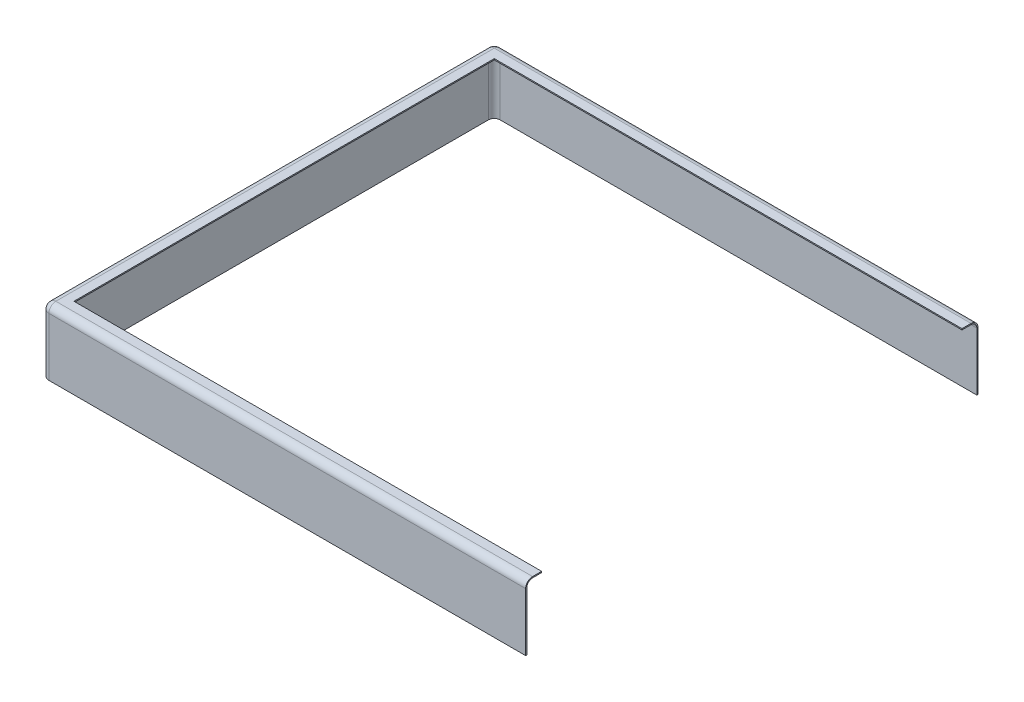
ISO-10303-21;
HEADER;
FILE_DESCRIPTION(('STEP AP214'),'2;1');
FILE_NAME('part.step','',(''),(''),'','','');
FILE_SCHEMA(('AUTOMOTIVE_DESIGN { 1 0 10303 214 1 1 1 1 }'));
ENDSEC;
DATA;
#1=APPLICATION_CONTEXT('core data for automotive mechanical design processes');
#2=APPLICATION_PROTOCOL_DEFINITION('international standard','automotive_design',2000,#1);
#3=PRODUCT_CONTEXT('',#1,'mechanical');
#4=PRODUCT('Part','Part','',(#3));
#5=PRODUCT_RELATED_PRODUCT_CATEGORY('part','',(#4));
#6=PRODUCT_DEFINITION_FORMATION('','',#4);
#7=PRODUCT_DEFINITION_CONTEXT('part definition',#1,'design');
#8=PRODUCT_DEFINITION('design','',#6,#7);
#9=PRODUCT_DEFINITION_SHAPE('','',#8);
#10=(LENGTH_UNIT() NAMED_UNIT(*) SI_UNIT(.MILLI.,.METRE.));
#11=(NAMED_UNIT(*) PLANE_ANGLE_UNIT() SI_UNIT($,.RADIAN.));
#12=(NAMED_UNIT(*) SI_UNIT($,.STERADIAN.) SOLID_ANGLE_UNIT());
#13=UNCERTAINTY_MEASURE_WITH_UNIT(LENGTH_MEASURE(1.E-05),#10,'distance_accuracy_value','');
#14=(GEOMETRIC_REPRESENTATION_CONTEXT(3) GLOBAL_UNCERTAINTY_ASSIGNED_CONTEXT((#13)) GLOBAL_UNIT_ASSIGNED_CONTEXT((#10,
#11,#12)) REPRESENTATION_CONTEXT('',''));
#15=CARTESIAN_POINT('',(0.,0.,0.));
#16=DIRECTION('',(0.,0.,1.));
#17=DIRECTION('',(1.,0.,0.));
#18=AXIS2_PLACEMENT_3D('',#15,#16,#17);
#19=CARTESIAN_POINT('',(2078.,0.,1938.));
#20=DIRECTION('',(-1.,0.,0.));
#21=DIRECTION('',(0.,0.,1.));
#22=AXIS2_PLACEMENT_3D('',#19,#20,#21);
#23=PLANE('',#22);
#24=DIRECTION('',(0.,1.,0.));
#25=VECTOR('',#24,1.);
#26=CARTESIAN_POINT('',(2078.,0.,0.));
#27=LINE('',#26,#25);
#28=CARTESIAN_POINT('',(2078.,-275.,0.));
#29=VERTEX_POINT('',#28);
#30=CARTESIAN_POINT('',(2078.,-25.,0.));
#31=VERTEX_POINT('',#30);
#32=EDGE_CURVE('E365',#29,#31,#27,.T.);
#33=ORIENTED_EDGE('',*,*,#32,.F.);
#34=DIRECTION('',(0.,0.,-1.));
#35=VECTOR('',#34,1.);
#36=CARTESIAN_POINT('',(2078.,-275.,1938.));
#37=LINE('',#36,#35);
#38=CARTESIAN_POINT('',(2078.,-275.,-4.99999999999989));
#39=VERTEX_POINT('',#38);
#40=EDGE_CURVE('E205',#29,#39,#37,.T.);
#41=ORIENTED_EDGE('',*,*,#40,.T.);
#42=DIRECTION('',(0.,1.,0.));
#43=VECTOR('',#42,1.);
#44=CARTESIAN_POINT('',(2078.,0.,-4.99999999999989));
#45=LINE('',#44,#43);
#46=CARTESIAN_POINT('',(2078.,-25.,-5.));
#47=VERTEX_POINT('',#46);
#48=EDGE_CURVE('E185',#39,#47,#45,.T.);
#49=ORIENTED_EDGE('',*,*,#48,.T.);
#50=CARTESIAN_POINT('',(2078.,-25.,24.9999999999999));
#51=DIRECTION('',(-1.,0.,0.));
#52=DIRECTION('',(0.,0.,1.));
#53=AXIS2_PLACEMENT_3D('',#50,#51,#52);
#54=CIRCLE('',#53,30.);
#55=CARTESIAN_POINT('',(2078.,5.,24.9999999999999));
#56=VERTEX_POINT('',#55);
#57=EDGE_CURVE('E11',#47,#56,#54,.F.);
#58=ORIENTED_EDGE('',*,*,#57,.T.);
#59=DIRECTION('',(0.,0.,-1.));
#60=VECTOR('',#59,1.);
#61=CARTESIAN_POINT('',(2078.,5.,1938.));
#62=LINE('',#61,#60);
#63=CARTESIAN_POINT('',(2078.,5.,64.0000000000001));
#64=VERTEX_POINT('',#63);
#65=EDGE_CURVE('E189',#64,#56,#62,.T.);
#66=ORIENTED_EDGE('',*,*,#65,.F.);
#67=DIRECTION('',(0.,1.,0.));
#68=VECTOR('',#67,1.);
#69=CARTESIAN_POINT('',(2078.,-275.,64.0000000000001));
#70=LINE('',#69,#68);
#71=CARTESIAN_POINT('',(2078.,0.,64.0000000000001));
#72=VERTEX_POINT('',#71);
#73=EDGE_CURVE('E202',#72,#64,#70,.T.);
#74=ORIENTED_EDGE('',*,*,#73,.F.);
#75=DIRECTION('',(0.,0.,-1.));
#76=VECTOR('',#75,1.);
#77=CARTESIAN_POINT('',(2078.,0.,1938.));
#78=LINE('',#77,#76);
#79=CARTESIAN_POINT('',(2078.,0.,24.9999999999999));
#80=VERTEX_POINT('',#79);
#81=EDGE_CURVE('E54',#72,#80,#78,.T.);
#82=ORIENTED_EDGE('',*,*,#81,.T.);
#83=CARTESIAN_POINT('',(2078.,-25.,24.9999999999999));
#84=DIRECTION('',(-1.,0.,0.));
#85=DIRECTION('',(0.,0.,1.));
#86=AXIS2_PLACEMENT_3D('',#83,#84,#85);
#87=CIRCLE('',#86,25.);
#88=EDGE_CURVE('E179',#31,#80,#87,.F.);
#89=ORIENTED_EDGE('',*,*,#88,.F.);
#90=EDGE_LOOP('',(#33,#41,#49,#58,#66,#74,#82,#89));
#91=FACE_BOUND('',#90,.T.);
#92=ADVANCED_FACE('F37',(#91),#23,.F.);
#93=CARTESIAN_POINT('',(2078.,-275.,1874.));
#94=DIRECTION('',(0.,0.,1.));
#95=DIRECTION('',(1.,0.,0.));
#96=AXIS2_PLACEMENT_3D('',#93,#94,#95);
#97=PLANE('',#96);
#98=DIRECTION('',(1.,0.,0.));
#99=VECTOR('',#98,1.);
#100=CARTESIAN_POINT('',(2078.,0.,1874.));
#101=LINE('',#100,#99);
#102=CARTESIAN_POINT('',(64.0000000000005,0.,1874.));
#103=VERTEX_POINT('',#102);
#104=CARTESIAN_POINT('',(2078.,0.,1874.));
#105=VERTEX_POINT('',#104);
#106=EDGE_CURVE('E304',#103,#105,#101,.T.);
#107=ORIENTED_EDGE('',*,*,#106,.F.);
#108=DIRECTION('',(0.,1.,0.));
#109=VECTOR('',#108,1.);
#110=CARTESIAN_POINT('',(64.0000000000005,-275.,1874.));
#111=LINE('',#110,#109);
#112=CARTESIAN_POINT('',(64.0000000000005,5.,1874.));
#113=VERTEX_POINT('',#112);
#114=EDGE_CURVE('E303',#103,#113,#111,.T.);
#115=ORIENTED_EDGE('',*,*,#114,.T.);
#116=DIRECTION('',(1.,0.,0.));
#117=VECTOR('',#116,1.);
#118=CARTESIAN_POINT('',(2078.,5.,1874.));
#119=LINE('',#118,#117);
#120=CARTESIAN_POINT('',(2078.,5.,1874.));
#121=VERTEX_POINT('',#120);
#122=EDGE_CURVE('E199',#113,#121,#119,.T.);
#123=ORIENTED_EDGE('',*,*,#122,.T.);
#124=DIRECTION('',(0.,1.,0.));
#125=VECTOR('',#124,1.);
#126=CARTESIAN_POINT('',(2078.,-275.,1874.));
#127=LINE('',#126,#125);
#128=EDGE_CURVE('E186',#105,#121,#127,.T.);
#129=ORIENTED_EDGE('',*,*,#128,.F.);
#130=EDGE_LOOP('',(#107,#115,#123,#129));
#131=FACE_BOUND('',#130,.T.);
#132=ADVANCED_FACE('F381',(#131),#97,.F.);
#133=CARTESIAN_POINT('',(64.0000000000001,-275.,64.0000000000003));
#134=DIRECTION('',(-1.,0.,0.));
#135=DIRECTION('',(0.,0.,1.));
#136=AXIS2_PLACEMENT_3D('',#133,#134,#135);
#137=PLANE('',#136);
#138=DIRECTION('',(0.,0.,1.));
#139=VECTOR('',#138,1.);
#140=CARTESIAN_POINT('',(64.0000000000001,0.,64.0000000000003));
#141=LINE('',#140,#139);
#142=CARTESIAN_POINT('',(64.0000000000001,0.,64.0000000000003));
#143=VERTEX_POINT('',#142);
#144=EDGE_CURVE('E292',#143,#103,#141,.T.);
#145=ORIENTED_EDGE('',*,*,#144,.F.);
#146=DIRECTION('',(0.,1.,0.));
#147=VECTOR('',#146,1.);
#148=CARTESIAN_POINT('',(64.0000000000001,-275.,64.0000000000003));
#149=LINE('',#148,#147);
#150=CARTESIAN_POINT('',(64.0000000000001,5.,64.0000000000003));
#151=VERTEX_POINT('',#150);
#152=EDGE_CURVE('E302',#143,#151,#149,.T.);
#153=ORIENTED_EDGE('',*,*,#152,.T.);
#154=DIRECTION('',(0.,0.,1.));
#155=VECTOR('',#154,1.);
#156=CARTESIAN_POINT('',(64.0000000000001,5.,64.0000000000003));
#157=LINE('',#156,#155);
#158=EDGE_CURVE('E196',#151,#113,#157,.T.);
#159=ORIENTED_EDGE('',*,*,#158,.T.);
#160=ORIENTED_EDGE('',*,*,#114,.F.);
#161=EDGE_LOOP('',(#145,#153,#159,#160));
#162=FACE_BOUND('',#161,.T.);
#163=ADVANCED_FACE('F301',(#162),#137,.F.);
#164=CARTESIAN_POINT('',(2078.,-275.,64.0000000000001));
#165=DIRECTION('',(0.,0.,-1.));
#166=DIRECTION('',(-1.,0.,0.));
#167=AXIS2_PLACEMENT_3D('',#164,#165,#166);
#168=PLANE('',#167);
#169=DIRECTION('',(-1.,0.,0.));
#170=VECTOR('',#169,1.);
#171=CARTESIAN_POINT('',(2078.,0.,64.0000000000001));
#172=LINE('',#171,#170);
#173=EDGE_CURVE('E288',#72,#143,#172,.T.);
#174=ORIENTED_EDGE('',*,*,#173,.F.);
#175=ORIENTED_EDGE('',*,*,#73,.T.);
#176=DIRECTION('',(-1.,0.,0.));
#177=VECTOR('',#176,1.);
#178=CARTESIAN_POINT('',(2078.,5.,64.0000000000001));
#179=LINE('',#178,#177);
#180=EDGE_CURVE('E161',#64,#151,#179,.T.);
#181=ORIENTED_EDGE('',*,*,#180,.T.);
#182=ORIENTED_EDGE('',*,*,#152,.F.);
#183=EDGE_LOOP('',(#174,#175,#181,#182));
#184=FACE_BOUND('',#183,.T.);
#185=ADVANCED_FACE('F306',(#184),#168,.F.);
#186=CARTESIAN_POINT('',(2078.,-25.,1913.));
#187=DIRECTION('',(-1.,0.,0.));
#188=DIRECTION('',(0.,0.,1.));
#189=AXIS2_PLACEMENT_3D('',#186,#187,#188);
#190=CIRCLE('',#189,25.);
#191=CARTESIAN_POINT('',(2078.,0.,1913.));
#192=VERTEX_POINT('',#191);
#193=CARTESIAN_POINT('',(2078.,-25.,1938.));
#194=VERTEX_POINT('',#193);
#195=EDGE_CURVE('E332',#192,#194,#190,.F.);
#196=ORIENTED_EDGE('',*,*,#195,.F.);
#197=EDGE_CURVE('E362',#192,#105,#78,.T.);
#198=ORIENTED_EDGE('',*,*,#197,.T.);
#199=ORIENTED_EDGE('',*,*,#128,.T.);
#200=DIRECTION('',(0.,0.,-1.));
#201=VECTOR('',#200,1.);
#202=CARTESIAN_POINT('',(2078.,5.,1938.));
#203=LINE('',#202,#201);
#204=CARTESIAN_POINT('',(2078.,5.,1913.));
#205=VERTEX_POINT('',#204);
#206=EDGE_CURVE('E192',#205,#121,#203,.T.);
#207=ORIENTED_EDGE('',*,*,#206,.F.);
#208=CARTESIAN_POINT('',(2078.,-25.,1913.));
#209=DIRECTION('',(-1.,0.,0.));
#210=DIRECTION('',(0.,0.,1.));
#211=AXIS2_PLACEMENT_3D('',#208,#209,#210);
#212=CIRCLE('',#211,30.);
#213=CARTESIAN_POINT('',(2078.,-25.,1943.));
#214=VERTEX_POINT('',#213);
#215=EDGE_CURVE('E46',#205,#214,#212,.F.);
#216=ORIENTED_EDGE('',*,*,#215,.T.);
#217=DIRECTION('',(0.,1.,0.));
#218=VECTOR('',#217,1.);
#219=CARTESIAN_POINT('',(2078.,0.,1943.));
#220=LINE('',#219,#218);
#221=CARTESIAN_POINT('',(2078.,-275.,1943.));
#222=VERTEX_POINT('',#221);
#223=EDGE_CURVE('E193',#222,#214,#220,.T.);
#224=ORIENTED_EDGE('',*,*,#223,.F.);
#225=CARTESIAN_POINT('',(2078.,-275.,1938.));
#226=VERTEX_POINT('',#225);
#227=EDGE_CURVE('E139',#222,#226,#37,.T.);
#228=ORIENTED_EDGE('',*,*,#227,.T.);
#229=DIRECTION('',(0.,1.,0.));
#230=VECTOR('',#229,1.);
#231=CARTESIAN_POINT('',(2078.,0.,1938.));
#232=LINE('',#231,#230);
#233=EDGE_CURVE('E372',#226,#194,#232,.T.);
#234=ORIENTED_EDGE('',*,*,#233,.T.);
#235=EDGE_LOOP('',(#196,#198,#199,#207,#216,#224,#228,#234));
#236=FACE_BOUND('',#235,.T.);
#237=ADVANCED_FACE('F219',(#236),#23,.F.);
#238=CARTESIAN_POINT('',(-5.,0.,1938.));
#239=DIRECTION('',(1.,0.,0.));
#240=DIRECTION('',(0.,1.,0.));
#241=AXIS2_PLACEMENT_3D('',#238,#239,#240);
#242=PLANE('',#241);
#243=DIRECTION('',(0.,0.,1.));
#244=VECTOR('',#243,1.);
#245=CARTESIAN_POINT('',(-5.,-25.,1938.));
#246=LINE('',#245,#244);
#247=CARTESIAN_POINT('',(-5.,-25.,1913.));
#248=VERTEX_POINT('',#247);
#249=CARTESIAN_POINT('',(-5.,-25.,24.9999999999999));
#250=VERTEX_POINT('',#249);
#251=EDGE_CURVE('E145',#248,#250,#246,.F.);
#252=ORIENTED_EDGE('',*,*,#251,.T.);
#253=DIRECTION('',(0.,1.,0.));
#254=VECTOR('',#253,1.);
#255=CARTESIAN_POINT('',(-5.,0.,24.9999999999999));
#256=LINE('',#255,#254);
#257=CARTESIAN_POINT('',(-4.99999999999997,-275.,24.9999999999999));
#258=VERTEX_POINT('',#257);
#259=EDGE_CURVE('E130',#250,#258,#256,.F.);
#260=ORIENTED_EDGE('',*,*,#259,.T.);
#261=DIRECTION('',(0.,0.,-1.));
#262=VECTOR('',#261,1.);
#263=CARTESIAN_POINT('',(-4.99999999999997,-275.,1938.));
#264=LINE('',#263,#262);
#265=CARTESIAN_POINT('',(-4.99999999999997,-275.,1913.));
#266=VERTEX_POINT('',#265);
#267=EDGE_CURVE('E124',#266,#258,#264,.T.);
#268=ORIENTED_EDGE('',*,*,#267,.F.);
#269=DIRECTION('',(0.,1.,0.));
#270=VECTOR('',#269,1.);
#271=CARTESIAN_POINT('',(-5.,0.,1913.));
#272=LINE('',#271,#270);
#273=EDGE_CURVE('E136',#266,#248,#272,.T.);
#274=ORIENTED_EDGE('',*,*,#273,.T.);
#275=EDGE_LOOP('',(#252,#260,#268,#274));
#276=FACE_BOUND('',#275,.T.);
#277=ADVANCED_FACE('F135',(#276),#242,.F.);
#278=CARTESIAN_POINT('',(0.,-275.,1938.));
#279=DIRECTION('',(0.,1.,0.));
#280=DIRECTION('',(0.,0.,1.));
#281=AXIS2_PLACEMENT_3D('',#278,#279,#280);
#282=PLANE('',#281);
#283=DIRECTION('',(1.,0.,0.));
#284=VECTOR('',#283,1.);
#285=CARTESIAN_POINT('',(0.,-275.,0.));
#286=LINE('',#285,#284);
#287=CARTESIAN_POINT('',(25.,-275.,0.));
#288=VERTEX_POINT('',#287);
#289=EDGE_CURVE('E369',#288,#29,#286,.T.);
#290=ORIENTED_EDGE('',*,*,#289,.F.);
#291=CARTESIAN_POINT('',(25.,-275.,24.9999999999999));
#292=DIRECTION('',(0.,1.,0.));
#293=DIRECTION('',(0.,0.,1.));
#294=AXIS2_PLACEMENT_3D('',#291,#292,#293);
#295=CIRCLE('',#294,25.);
#296=CARTESIAN_POINT('',(0.,-275.,24.9999999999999));
#297=VERTEX_POINT('',#296);
#298=EDGE_CURVE('E348',#297,#288,#295,.F.);
#299=ORIENTED_EDGE('',*,*,#298,.F.);
#300=DIRECTION('',(0.,0.,-1.));
#301=VECTOR('',#300,1.);
#302=CARTESIAN_POINT('',(0.,-275.,1938.));
#303=LINE('',#302,#301);
#304=CARTESIAN_POINT('',(0.,-275.,1913.));
#305=VERTEX_POINT('',#304);
#306=EDGE_CURVE('E358',#305,#297,#303,.T.);
#307=ORIENTED_EDGE('',*,*,#306,.F.);
#308=CARTESIAN_POINT('',(25.,-275.,1913.));
#309=DIRECTION('',(0.,1.,0.));
#310=DIRECTION('',(0.,0.,1.));
#311=AXIS2_PLACEMENT_3D('',#308,#309,#310);
#312=CIRCLE('',#311,25.);
#313=CARTESIAN_POINT('',(25.,-275.,1938.));
#314=VERTEX_POINT('',#313);
#315=EDGE_CURVE('E350',#314,#305,#312,.F.);
#316=ORIENTED_EDGE('',*,*,#315,.F.);
#317=DIRECTION('',(1.,0.,0.));
#318=VECTOR('',#317,1.);
#319=CARTESIAN_POINT('',(0.,-275.,1938.));
#320=LINE('',#319,#318);
#321=EDGE_CURVE('E214',#314,#226,#320,.T.);
#322=ORIENTED_EDGE('',*,*,#321,.T.);
#323=ORIENTED_EDGE('',*,*,#227,.F.);
#324=DIRECTION('',(1.,0.,0.));
#325=VECTOR('',#324,1.);
#326=CARTESIAN_POINT('',(0.,-275.,1943.));
#327=LINE('',#326,#325);
#328=CARTESIAN_POINT('',(25.,-275.,1943.));
#329=VERTEX_POINT('',#328);
#330=EDGE_CURVE('E126',#329,#222,#327,.T.);
#331=ORIENTED_EDGE('',*,*,#330,.F.);
#332=CARTESIAN_POINT('',(25.,-275.,1913.));
#333=DIRECTION('',(0.,1.,0.));
#334=DIRECTION('',(0.,0.,1.));
#335=AXIS2_PLACEMENT_3D('',#332,#333,#334);
#336=CIRCLE('',#335,30.);
#337=EDGE_CURVE('E41',#329,#266,#336,.F.);
#338=ORIENTED_EDGE('',*,*,#337,.T.);
#339=ORIENTED_EDGE('',*,*,#267,.T.);
#340=CARTESIAN_POINT('',(25.,-275.,24.9999999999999));
#341=DIRECTION('',(0.,1.,0.));
#342=DIRECTION('',(0.,0.,1.));
#343=AXIS2_PLACEMENT_3D('',#340,#341,#342);
#344=CIRCLE('',#343,30.);
#345=CARTESIAN_POINT('',(25.,-275.,-5.));
#346=VERTEX_POINT('',#345);
#347=EDGE_CURVE('E129',#258,#346,#344,.F.);
#348=ORIENTED_EDGE('',*,*,#347,.T.);
#349=DIRECTION('',(1.,0.,0.));
#350=VECTOR('',#349,1.);
#351=CARTESIAN_POINT('',(0.,-275.,-4.99999999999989));
#352=LINE('',#351,#350);
#353=EDGE_CURVE('E182',#346,#39,#352,.T.);
#354=ORIENTED_EDGE('',*,*,#353,.T.);
#355=ORIENTED_EDGE('',*,*,#40,.F.);
#356=EDGE_LOOP('',(#290,#299,#307,#316,#322,#323,#331,#338,#339,#348,#354,#355));
#357=FACE_BOUND('',#356,.T.);
#358=ADVANCED_FACE('F123',(#357),#282,.F.);
#359=CARTESIAN_POINT('',(0.,5.,1938.));
#360=DIRECTION('',(0.,-1.,0.));
#361=DIRECTION('',(0.,0.,-1.));
#362=AXIS2_PLACEMENT_3D('',#359,#360,#361);
#363=PLANE('',#362);
#364=DIRECTION('',(0.,0.,-1.));
#365=VECTOR('',#364,1.);
#366=CARTESIAN_POINT('',(25.,5.,1938.));
#367=LINE('',#366,#365);
#368=CARTESIAN_POINT('',(25.,5.,24.9999999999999));
#369=VERTEX_POINT('',#368);
#370=CARTESIAN_POINT('',(25.,5.,1913.));
#371=VERTEX_POINT('',#370);
#372=EDGE_CURVE('E158',#369,#371,#367,.F.);
#373=ORIENTED_EDGE('',*,*,#372,.T.);
#374=DIRECTION('',(1.,0.,0.));
#375=VECTOR('',#374,1.);
#376=CARTESIAN_POINT('',(0.,5.,1913.));
#377=LINE('',#376,#375);
#378=EDGE_CURVE('E156',#371,#205,#377,.T.);
#379=ORIENTED_EDGE('',*,*,#378,.T.);
#380=ORIENTED_EDGE('',*,*,#206,.T.);
#381=ORIENTED_EDGE('',*,*,#122,.F.);
#382=ORIENTED_EDGE('',*,*,#158,.F.);
#383=ORIENTED_EDGE('',*,*,#180,.F.);
#384=ORIENTED_EDGE('',*,*,#65,.T.);
#385=DIRECTION('',(1.,0.,0.));
#386=VECTOR('',#385,1.);
#387=CARTESIAN_POINT('',(0.,5.,24.9999999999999));
#388=LINE('',#387,#386);
#389=EDGE_CURVE('E163',#56,#369,#388,.F.);
#390=ORIENTED_EDGE('',*,*,#389,.T.);
#391=EDGE_LOOP('',(#373,#379,#380,#381,#382,#383,#384,#390));
#392=FACE_BOUND('',#391,.T.);
#393=ADVANCED_FACE('F384',(#392),#363,.F.);
#394=CARTESIAN_POINT('',(0.,0.,1943.));
#395=DIRECTION('',(0.,0.,1.));
#396=DIRECTION('',(1.,0.,0.));
#397=AXIS2_PLACEMENT_3D('',#394,#395,#396);
#398=PLANE('',#397);
#399=DIRECTION('',(1.,0.,0.));
#400=VECTOR('',#399,1.);
#401=CARTESIAN_POINT('',(0.,-25.,1943.));
#402=LINE('',#401,#400);
#403=CARTESIAN_POINT('',(25.,-25.,1943.));
#404=VERTEX_POINT('',#403);
#405=EDGE_CURVE('E63',#214,#404,#402,.F.);
#406=ORIENTED_EDGE('',*,*,#405,.T.);
#407=DIRECTION('',(0.,1.,0.));
#408=VECTOR('',#407,1.);
#409=CARTESIAN_POINT('',(25.,0.,1943.));
#410=LINE('',#409,#408);
#411=EDGE_CURVE('E150',#404,#329,#410,.F.);
#412=ORIENTED_EDGE('',*,*,#411,.T.);
#413=ORIENTED_EDGE('',*,*,#330,.T.);
#414=ORIENTED_EDGE('',*,*,#223,.T.);
#415=EDGE_LOOP('',(#406,#412,#413,#414));
#416=FACE_BOUND('',#415,.T.);
#417=ADVANCED_FACE('F207',(#416),#398,.T.);
#418=CARTESIAN_POINT('',(0.,0.,-5.));
#419=DIRECTION('',(0.,0.,1.));
#420=DIRECTION('',(1.,0.,0.));
#421=AXIS2_PLACEMENT_3D('',#418,#419,#420);
#422=PLANE('',#421);
#423=ORIENTED_EDGE('',*,*,#353,.F.);
#424=DIRECTION('',(0.,1.,0.));
#425=VECTOR('',#424,1.);
#426=CARTESIAN_POINT('',(25.,0.,-5.));
#427=LINE('',#426,#425);
#428=CARTESIAN_POINT('',(25.,-25.,-5.));
#429=VERTEX_POINT('',#428);
#430=EDGE_CURVE('E165',#346,#429,#427,.T.);
#431=ORIENTED_EDGE('',*,*,#430,.T.);
#432=DIRECTION('',(1.,0.,0.));
#433=VECTOR('',#432,1.);
#434=CARTESIAN_POINT('',(0.,-25.,-5.));
#435=LINE('',#434,#433);
#436=EDGE_CURVE('E173',#429,#47,#435,.T.);
#437=ORIENTED_EDGE('',*,*,#436,.T.);
#438=ORIENTED_EDGE('',*,*,#48,.F.);
#439=EDGE_LOOP('',(#423,#431,#437,#438));
#440=FACE_BOUND('',#439,.T.);
#441=ADVANCED_FACE('F399',(#440),#422,.F.);
#442=CARTESIAN_POINT('',(0.,-25.,1913.));
#443=DIRECTION('',(1.,0.,0.));
#444=DIRECTION('',(0.,0.,-1.));
#445=AXIS2_PLACEMENT_3D('',#442,#443,#444);
#446=CYLINDRICAL_SURFACE('',#445,30.);
#447=ORIENTED_EDGE('',*,*,#215,.F.);
#448=ORIENTED_EDGE('',*,*,#378,.F.);
#449=CARTESIAN_POINT('',(25.,-25.,1913.));
#450=DIRECTION('',(1.,0.,0.));
#451=DIRECTION('',(0.,1.,0.));
#452=AXIS2_PLACEMENT_3D('',#449,#450,#451);
#453=CIRCLE('',#452,30.);
#454=EDGE_CURVE('E153',#404,#371,#453,.F.);
#455=ORIENTED_EDGE('',*,*,#454,.F.);
#456=ORIENTED_EDGE('',*,*,#405,.F.);
#457=EDGE_LOOP('',(#447,#448,#455,#456));
#458=FACE_BOUND('',#457,.T.);
#459=ADVANCED_FACE('F224',(#458),#446,.T.);
#460=CARTESIAN_POINT('',(25.,0.,1913.));
#461=DIRECTION('',(0.,1.,0.));
#462=DIRECTION('',(-1.,0.,0.));
#463=AXIS2_PLACEMENT_3D('',#460,#461,#462);
#464=CYLINDRICAL_SURFACE('',#463,30.);
#465=ORIENTED_EDGE('',*,*,#337,.F.);
#466=ORIENTED_EDGE('',*,*,#411,.F.);
#467=CARTESIAN_POINT('',(25.,-25.,1913.));
#468=DIRECTION('',(0.,1.,0.));
#469=DIRECTION('',(-1.,0.,0.));
#470=AXIS2_PLACEMENT_3D('',#467,#468,#469);
#471=CIRCLE('',#470,30.);
#472=EDGE_CURVE('E143',#248,#404,#471,.T.);
#473=ORIENTED_EDGE('',*,*,#472,.F.);
#474=ORIENTED_EDGE('',*,*,#273,.F.);
#475=EDGE_LOOP('',(#465,#466,#473,#474));
#476=FACE_BOUND('',#475,.T.);
#477=ADVANCED_FACE('F141',(#476),#464,.T.);
#478=CARTESIAN_POINT('',(25.,-25.,1913.));
#479=DIRECTION('',(0.,0.,1.));
#480=DIRECTION('',(1.,0.,0.));
#481=AXIS2_PLACEMENT_3D('',#478,#479,#480);
#482=SPHERICAL_SURFACE('',#481,30.);
#483=ORIENTED_EDGE('',*,*,#472,.T.);
#484=ORIENTED_EDGE('',*,*,#454,.T.);
#485=CARTESIAN_POINT('',(25.,-25.,1913.));
#486=DIRECTION('',(0.,0.,-1.));
#487=DIRECTION('',(-1.,0.,0.));
#488=AXIS2_PLACEMENT_3D('',#485,#486,#487);
#489=CIRCLE('',#488,30.);
#490=EDGE_CURVE('E154',#248,#371,#489,.T.);
#491=ORIENTED_EDGE('',*,*,#490,.F.);
#492=EDGE_LOOP('',(#483,#484,#491));
#493=FACE_BOUND('',#492,.T.);
#494=ADVANCED_FACE('F227',(#493),#482,.T.);
#495=CARTESIAN_POINT('',(0.,-25.,24.9999999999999));
#496=DIRECTION('',(-1.,0.,0.));
#497=DIRECTION('',(0.,0.,1.));
#498=AXIS2_PLACEMENT_3D('',#495,#496,#497);
#499=CYLINDRICAL_SURFACE('',#498,30.);
#500=ORIENTED_EDGE('',*,*,#57,.F.);
#501=ORIENTED_EDGE('',*,*,#436,.F.);
#502=CARTESIAN_POINT('',(25.,-25.,25.));
#503=DIRECTION('',(1.,0.,0.));
#504=DIRECTION('',(0.,0.,-1.));
#505=AXIS2_PLACEMENT_3D('',#502,#503,#504);
#506=CIRCLE('',#505,30.);
#507=EDGE_CURVE('E168',#369,#429,#506,.F.);
#508=ORIENTED_EDGE('',*,*,#507,.F.);
#509=ORIENTED_EDGE('',*,*,#389,.F.);
#510=EDGE_LOOP('',(#500,#501,#508,#509));
#511=FACE_BOUND('',#510,.T.);
#512=ADVANCED_FACE('F390',(#511),#499,.T.);
#513=CARTESIAN_POINT('',(25.,-25.,1938.));
#514=DIRECTION('',(0.,0.,-1.));
#515=DIRECTION('',(-1.,0.,0.));
#516=AXIS2_PLACEMENT_3D('',#513,#514,#515);
#517=CYLINDRICAL_SURFACE('',#516,30.);
#518=ORIENTED_EDGE('',*,*,#490,.T.);
#519=ORIENTED_EDGE('',*,*,#372,.F.);
#520=CARTESIAN_POINT('',(25.,-25.,25.));
#521=DIRECTION('',(0.,0.,-1.));
#522=DIRECTION('',(0.,1.,0.));
#523=AXIS2_PLACEMENT_3D('',#520,#521,#522);
#524=CIRCLE('',#523,30.);
#525=EDGE_CURVE('E169',#250,#369,#524,.T.);
#526=ORIENTED_EDGE('',*,*,#525,.F.);
#527=ORIENTED_EDGE('',*,*,#251,.F.);
#528=EDGE_LOOP('',(#518,#519,#526,#527));
#529=FACE_BOUND('',#528,.T.);
#530=ADVANCED_FACE('F232',(#529),#517,.T.);
#531=CARTESIAN_POINT('',(25.,-25.,25.));
#532=DIRECTION('',(0.,1.,0.));
#533=DIRECTION('',(0.,0.,1.));
#534=AXIS2_PLACEMENT_3D('',#531,#532,#533);
#535=SPHERICAL_SURFACE('',#534,30.);
#536=ORIENTED_EDGE('',*,*,#525,.T.);
#537=ORIENTED_EDGE('',*,*,#507,.T.);
#538=CARTESIAN_POINT('',(25.,-25.,24.9999999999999));
#539=DIRECTION('',(0.,-1.,0.));
#540=DIRECTION('',(1.,0.,0.));
#541=AXIS2_PLACEMENT_3D('',#538,#539,#540);
#542=CIRCLE('',#541,30.);
#543=EDGE_CURVE('E172',#250,#429,#542,.T.);
#544=ORIENTED_EDGE('',*,*,#543,.F.);
#545=EDGE_LOOP('',(#536,#537,#544));
#546=FACE_BOUND('',#545,.T.);
#547=ADVANCED_FACE('F392',(#546),#535,.T.);
#548=CARTESIAN_POINT('',(25.,0.,24.9999999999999));
#549=DIRECTION('',(0.,-1.,0.));
#550=DIRECTION('',(1.,0.,0.));
#551=AXIS2_PLACEMENT_3D('',#548,#549,#550);
#552=CYLINDRICAL_SURFACE('',#551,30.);
#553=ORIENTED_EDGE('',*,*,#543,.T.);
#554=ORIENTED_EDGE('',*,*,#430,.F.);
#555=ORIENTED_EDGE('',*,*,#347,.F.);
#556=ORIENTED_EDGE('',*,*,#259,.F.);
#557=EDGE_LOOP('',(#553,#554,#555,#556));
#558=FACE_BOUND('',#557,.T.);
#559=ADVANCED_FACE('F39',(#558),#552,.T.);
#560=CARTESIAN_POINT('',(0.,0.,1938.));
#561=DIRECTION('',(1.,0.,0.));
#562=DIRECTION('',(0.,1.,0.));
#563=AXIS2_PLACEMENT_3D('',#560,#561,#562);
#564=PLANE('',#563);
#565=DIRECTION('',(0.,0.,-1.));
#566=VECTOR('',#565,1.);
#567=CARTESIAN_POINT('',(0.,-25.,1938.));
#568=LINE('',#567,#566);
#569=CARTESIAN_POINT('',(0.,-25.,1913.));
#570=VERTEX_POINT('',#569);
#571=CARTESIAN_POINT('',(0.,-25.,24.9999999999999));
#572=VERTEX_POINT('',#571);
#573=EDGE_CURVE('E354',#570,#572,#568,.T.);
#574=ORIENTED_EDGE('',*,*,#573,.F.);
#575=DIRECTION('',(0.,-1.,0.));
#576=VECTOR('',#575,1.);
#577=CARTESIAN_POINT('',(0.,0.,1913.));
#578=LINE('',#577,#576);
#579=EDGE_CURVE('E356',#305,#570,#578,.F.);
#580=ORIENTED_EDGE('',*,*,#579,.F.);
#581=ORIENTED_EDGE('',*,*,#306,.T.);
#582=DIRECTION('',(0.,-1.,0.));
#583=VECTOR('',#582,1.);
#584=CARTESIAN_POINT('',(0.,0.,24.9999999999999));
#585=LINE('',#584,#583);
#586=EDGE_CURVE('E352',#572,#297,#585,.T.);
#587=ORIENTED_EDGE('',*,*,#586,.F.);
#588=EDGE_LOOP('',(#574,#580,#581,#587));
#589=FACE_BOUND('',#588,.T.);
#590=ADVANCED_FACE('F417',(#589),#564,.T.);
#591=CARTESIAN_POINT('',(0.,0.,1938.));
#592=DIRECTION('',(0.,-1.,0.));
#593=DIRECTION('',(0.,0.,-1.));
#594=AXIS2_PLACEMENT_3D('',#591,#592,#593);
#595=PLANE('',#594);
#596=DIRECTION('',(0.,0.,-1.));
#597=VECTOR('',#596,1.);
#598=CARTESIAN_POINT('',(25.,0.,1938.));
#599=LINE('',#598,#597);
#600=CARTESIAN_POINT('',(25.,0.,24.9999999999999));
#601=VERTEX_POINT('',#600);
#602=CARTESIAN_POINT('',(25.,0.,1913.));
#603=VERTEX_POINT('',#602);
#604=EDGE_CURVE('E340',#601,#603,#599,.F.);
#605=ORIENTED_EDGE('',*,*,#604,.F.);
#606=DIRECTION('',(-1.,0.,0.));
#607=VECTOR('',#606,1.);
#608=CARTESIAN_POINT('',(0.,0.,24.9999999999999));
#609=LINE('',#608,#607);
#610=EDGE_CURVE('E342',#80,#601,#609,.T.);
#611=ORIENTED_EDGE('',*,*,#610,.F.);
#612=ORIENTED_EDGE('',*,*,#81,.F.);
#613=ORIENTED_EDGE('',*,*,#173,.T.);
#614=ORIENTED_EDGE('',*,*,#144,.T.);
#615=ORIENTED_EDGE('',*,*,#106,.T.);
#616=ORIENTED_EDGE('',*,*,#197,.F.);
#617=DIRECTION('',(-1.,0.,0.));
#618=VECTOR('',#617,1.);
#619=CARTESIAN_POINT('',(2078.,0.,1913.));
#620=LINE('',#619,#618);
#621=EDGE_CURVE('E338',#603,#192,#620,.F.);
#622=ORIENTED_EDGE('',*,*,#621,.F.);
#623=EDGE_LOOP('',(#605,#611,#612,#613,#614,#615,#616,#622));
#624=FACE_BOUND('',#623,.T.);
#625=ADVANCED_FACE('F291',(#624),#595,.T.);
#626=CARTESIAN_POINT('',(0.,0.,1938.));
#627=DIRECTION('',(0.,0.,1.));
#628=DIRECTION('',(1.,0.,0.));
#629=AXIS2_PLACEMENT_3D('',#626,#627,#628);
#630=PLANE('',#629);
#631=DIRECTION('',(-1.,0.,0.));
#632=VECTOR('',#631,1.);
#633=CARTESIAN_POINT('',(0.,-25.,1938.));
#634=LINE('',#633,#632);
#635=CARTESIAN_POINT('',(25.,-25.,1938.));
#636=VERTEX_POINT('',#635);
#637=EDGE_CURVE('E336',#194,#636,#634,.T.);
#638=ORIENTED_EDGE('',*,*,#637,.F.);
#639=ORIENTED_EDGE('',*,*,#233,.F.);
#640=ORIENTED_EDGE('',*,*,#321,.F.);
#641=DIRECTION('',(0.,-1.,0.));
#642=VECTOR('',#641,1.);
#643=CARTESIAN_POINT('',(25.,-275.,1938.));
#644=LINE('',#643,#642);
#645=EDGE_CURVE('E334',#636,#314,#644,.T.);
#646=ORIENTED_EDGE('',*,*,#645,.F.);
#647=EDGE_LOOP('',(#638,#639,#640,#646));
#648=FACE_BOUND('',#647,.T.);
#649=ADVANCED_FACE('F425',(#648),#630,.F.);
#650=CARTESIAN_POINT('',(0.,0.,0.));
#651=DIRECTION('',(0.,0.,1.));
#652=DIRECTION('',(1.,0.,0.));
#653=AXIS2_PLACEMENT_3D('',#650,#651,#652);
#654=PLANE('',#653);
#655=ORIENTED_EDGE('',*,*,#289,.T.);
#656=ORIENTED_EDGE('',*,*,#32,.T.);
#657=DIRECTION('',(-1.,0.,0.));
#658=VECTOR('',#657,1.);
#659=CARTESIAN_POINT('',(0.,-25.,0.));
#660=LINE('',#659,#658);
#661=CARTESIAN_POINT('',(25.,-25.,0.));
#662=VERTEX_POINT('',#661);
#663=EDGE_CURVE('E346',#662,#31,#660,.F.);
#664=ORIENTED_EDGE('',*,*,#663,.F.);
#665=DIRECTION('',(0.,-1.,0.));
#666=VECTOR('',#665,1.);
#667=CARTESIAN_POINT('',(25.,0.,0.));
#668=LINE('',#667,#666);
#669=EDGE_CURVE('E344',#288,#662,#668,.F.);
#670=ORIENTED_EDGE('',*,*,#669,.F.);
#671=EDGE_LOOP('',(#655,#656,#664,#670));
#672=FACE_BOUND('',#671,.T.);
#673=ADVANCED_FACE('F408',(#672),#654,.T.);
#674=CARTESIAN_POINT('',(0.,-25.,1913.));
#675=DIRECTION('',(1.,0.,0.));
#676=DIRECTION('',(0.,0.,-1.));
#677=AXIS2_PLACEMENT_3D('',#674,#675,#676);
#678=CYLINDRICAL_SURFACE('',#677,25.);
#679=ORIENTED_EDGE('',*,*,#195,.T.);
#680=ORIENTED_EDGE('',*,*,#637,.T.);
#681=CARTESIAN_POINT('',(25.,-25.,1913.));
#682=DIRECTION('',(-1.,0.,0.));
#683=DIRECTION('',(0.,0.,1.));
#684=AXIS2_PLACEMENT_3D('',#681,#682,#683);
#685=CIRCLE('',#684,25.);
#686=EDGE_CURVE('E297',#636,#603,#685,.T.);
#687=ORIENTED_EDGE('',*,*,#686,.T.);
#688=ORIENTED_EDGE('',*,*,#621,.T.);
#689=EDGE_LOOP('',(#679,#680,#687,#688));
#690=FACE_BOUND('',#689,.T.);
#691=ADVANCED_FACE('F427',(#690),#678,.F.);
#692=CARTESIAN_POINT('',(25.,0.,1913.));
#693=DIRECTION('',(0.,1.,0.));
#694=DIRECTION('',(-1.,0.,0.));
#695=AXIS2_PLACEMENT_3D('',#692,#693,#694);
#696=CYLINDRICAL_SURFACE('',#695,25.);
#697=ORIENTED_EDGE('',*,*,#315,.T.);
#698=ORIENTED_EDGE('',*,*,#579,.T.);
#699=CARTESIAN_POINT('',(25.,-25.,1913.));
#700=DIRECTION('',(0.,1.,0.));
#701=DIRECTION('',(-1.,0.,0.));
#702=AXIS2_PLACEMENT_3D('',#699,#700,#701);
#703=CIRCLE('',#702,25.);
#704=EDGE_CURVE('E316',#570,#636,#703,.T.);
#705=ORIENTED_EDGE('',*,*,#704,.T.);
#706=ORIENTED_EDGE('',*,*,#645,.T.);
#707=EDGE_LOOP('',(#697,#698,#705,#706));
#708=FACE_BOUND('',#707,.T.);
#709=ADVANCED_FACE('F419',(#708),#696,.F.);
#710=CARTESIAN_POINT('',(25.,-25.,1913.));
#711=DIRECTION('',(0.,0.,1.));
#712=DIRECTION('',(1.,0.,0.));
#713=AXIS2_PLACEMENT_3D('',#710,#711,#712);
#714=SPHERICAL_SURFACE('',#713,25.);
#715=ORIENTED_EDGE('',*,*,#704,.F.);
#716=CARTESIAN_POINT('',(25.,-25.,1913.));
#717=DIRECTION('',(0.,0.,1.));
#718=DIRECTION('',(1.,0.,0.));
#719=AXIS2_PLACEMENT_3D('',#716,#717,#718);
#720=CIRCLE('',#719,25.);
#721=EDGE_CURVE('E319',#570,#603,#720,.F.);
#722=ORIENTED_EDGE('',*,*,#721,.T.);
#723=ORIENTED_EDGE('',*,*,#686,.F.);
#724=EDGE_LOOP('',(#715,#722,#723));
#725=FACE_BOUND('',#724,.T.);
#726=ADVANCED_FACE('F437',(#725),#714,.F.);
#727=CARTESIAN_POINT('',(0.,-25.,24.9999999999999));
#728=DIRECTION('',(-1.,0.,0.));
#729=DIRECTION('',(0.,0.,1.));
#730=AXIS2_PLACEMENT_3D('',#727,#728,#729);
#731=CYLINDRICAL_SURFACE('',#730,25.);
#732=ORIENTED_EDGE('',*,*,#88,.T.);
#733=ORIENTED_EDGE('',*,*,#610,.T.);
#734=CARTESIAN_POINT('',(25.,-25.,24.9999999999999));
#735=DIRECTION('',(-1.,0.,0.));
#736=DIRECTION('',(0.,0.,1.));
#737=AXIS2_PLACEMENT_3D('',#734,#735,#736);
#738=CIRCLE('',#737,25.);
#739=EDGE_CURVE('E322',#601,#662,#738,.T.);
#740=ORIENTED_EDGE('',*,*,#739,.T.);
#741=ORIENTED_EDGE('',*,*,#663,.T.);
#742=EDGE_LOOP('',(#732,#733,#740,#741));
#743=FACE_BOUND('',#742,.T.);
#744=ADVANCED_FACE('F439',(#743),#731,.F.);
#745=CARTESIAN_POINT('',(25.,-25.,1938.));
#746=DIRECTION('',(0.,0.,-1.));
#747=DIRECTION('',(-1.,0.,0.));
#748=AXIS2_PLACEMENT_3D('',#745,#746,#747);
#749=CYLINDRICAL_SURFACE('',#748,25.);
#750=ORIENTED_EDGE('',*,*,#721,.F.);
#751=ORIENTED_EDGE('',*,*,#573,.T.);
#752=CARTESIAN_POINT('',(25.,-25.,24.9999999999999));
#753=DIRECTION('',(0.,0.,-1.));
#754=DIRECTION('',(-1.,0.,0.));
#755=AXIS2_PLACEMENT_3D('',#752,#753,#754);
#756=CIRCLE('',#755,25.);
#757=EDGE_CURVE('E325',#572,#601,#756,.T.);
#758=ORIENTED_EDGE('',*,*,#757,.T.);
#759=ORIENTED_EDGE('',*,*,#604,.T.);
#760=EDGE_LOOP('',(#750,#751,#758,#759));
#761=FACE_BOUND('',#760,.T.);
#762=ADVANCED_FACE('F435',(#761),#749,.F.);
#763=CARTESIAN_POINT('',(25.,-25.,25.));
#764=DIRECTION('',(0.,1.,0.));
#765=DIRECTION('',(0.,0.,1.));
#766=AXIS2_PLACEMENT_3D('',#763,#764,#765);
#767=SPHERICAL_SURFACE('',#766,25.);
#768=ORIENTED_EDGE('',*,*,#757,.F.);
#769=CARTESIAN_POINT('',(25.,-25.,25.));
#770=DIRECTION('',(0.,1.,0.));
#771=DIRECTION('',(-1.,0.,0.));
#772=AXIS2_PLACEMENT_3D('',#769,#770,#771);
#773=CIRCLE('',#772,25.);
#774=EDGE_CURVE('E328',#572,#662,#773,.F.);
#775=ORIENTED_EDGE('',*,*,#774,.T.);
#776=ORIENTED_EDGE('',*,*,#739,.F.);
#777=EDGE_LOOP('',(#768,#775,#776));
#778=FACE_BOUND('',#777,.T.);
#779=ADVANCED_FACE('F433',(#778),#767,.F.);
#780=CARTESIAN_POINT('',(25.,0.,24.9999999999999));
#781=DIRECTION('',(0.,-1.,0.));
#782=DIRECTION('',(1.,0.,0.));
#783=AXIS2_PLACEMENT_3D('',#780,#781,#782);
#784=CYLINDRICAL_SURFACE('',#783,25.);
#785=ORIENTED_EDGE('',*,*,#774,.F.);
#786=ORIENTED_EDGE('',*,*,#586,.T.);
#787=ORIENTED_EDGE('',*,*,#298,.T.);
#788=ORIENTED_EDGE('',*,*,#669,.T.);
#789=EDGE_LOOP('',(#785,#786,#787,#788));
#790=FACE_BOUND('',#789,.T.);
#791=ADVANCED_FACE('F412',(#790),#784,.F.);
#792=CLOSED_SHELL('',(#92,#132,#163,#185,#237,#277,#358,#393,#417,#441,#459,#477,#494,#512,#530,
#547,#559,#590,#625,#649,#673,#691,#709,#726,#744,#762,#779,#791));
#793=MANIFOLD_SOLID_BREP('B2',#792);
#794=ADVANCED_BREP_SHAPE_REPRESENTATION('',(#18,#793),#14);
#795=SHAPE_DEFINITION_REPRESENTATION(#9,#794);
ENDSEC;
END-ISO-10303-21;
